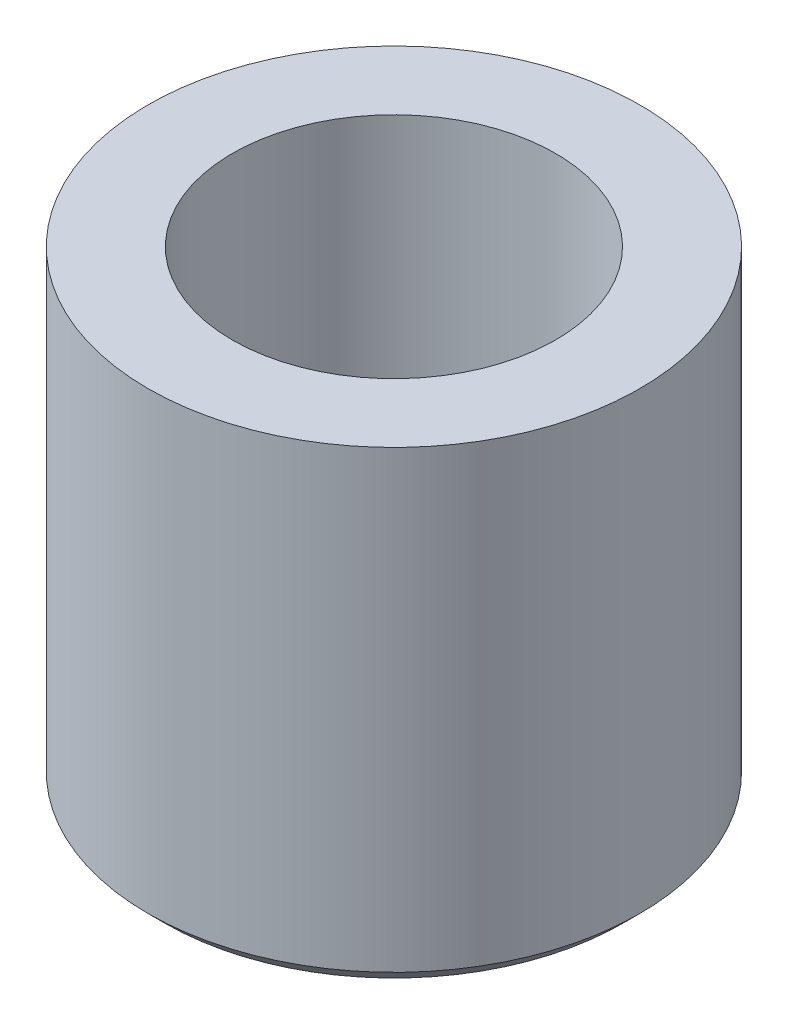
from build123d import *

# Parameters (mm, degrees)
SKETCH1_R           = 3.65
SKETCH1_R_2         = 2.4
BOSS_EXTRUDE1_DEPTH = 7
CHAMFER1_SIZE       = 0.25


with BuildPart() as part:
    # Sketch1 → Boss-Extrude1 (new body)
    with BuildSketch(Plane(origin=(0, 0, 0), x_dir=(1, 0, 0), z_dir=(0, 1, 0))):
        with Locations(Location((0, 0, 0), (0, 0, 270))):
            Circle(SKETCH1_R)
        with Locations(Location((0, 0, 0), (0, 0, 270))):
            Circle(SKETCH1_R_2, mode=Mode.SUBTRACT)
    extrude(amount=BOSS_EXTRUDE1_DEPTH)

    # Chamfer1
    chamfer1_edges = [part.edges().sort_by_distance(p)[0] for p in [
        (0, 0, -3.65),
        (0, 0, -2.4),
    ]]
    chamfer(chamfer1_edges, length=CHAMFER1_SIZE)


solid = part.part
